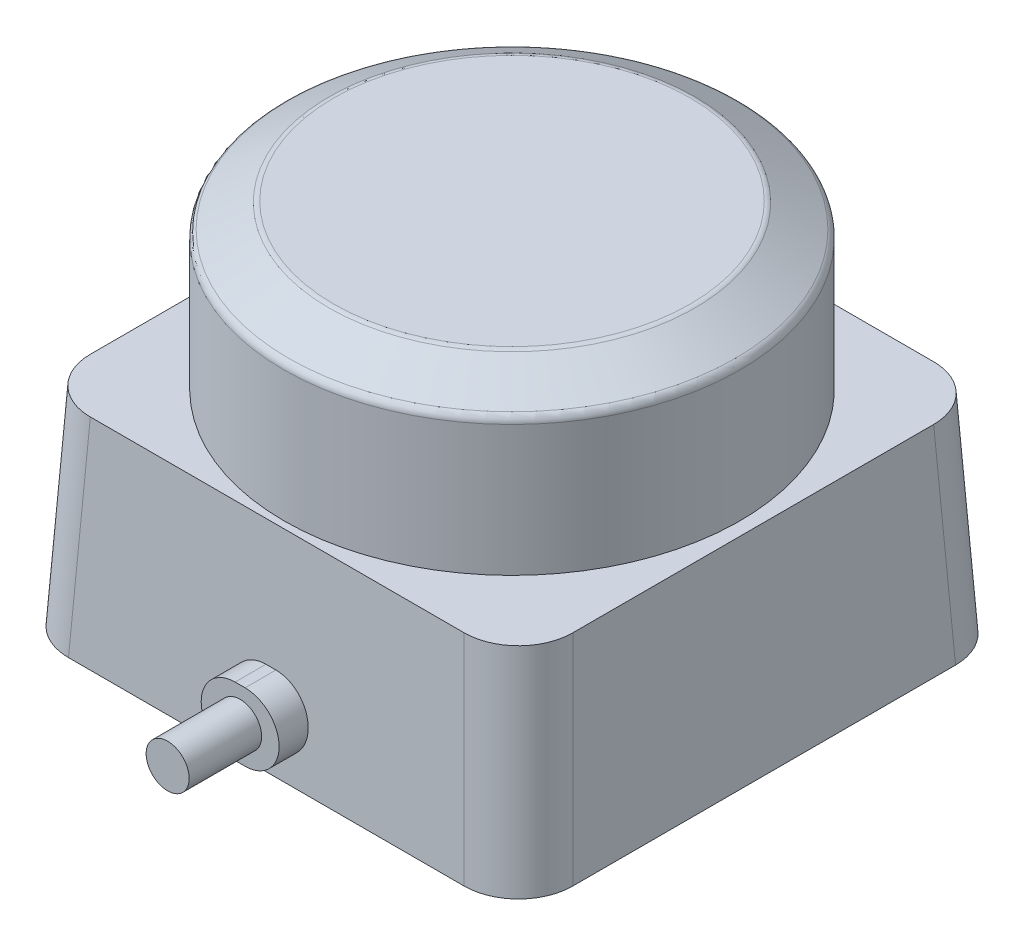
ISO-10303-21;
HEADER;
FILE_DESCRIPTION(('STEP AP214'),'2;1');
FILE_NAME('part.step','',(''),(''),'','','');
FILE_SCHEMA(('AUTOMOTIVE_DESIGN { 1 0 10303 214 1 1 1 1 }'));
ENDSEC;
DATA;
#1=APPLICATION_CONTEXT('core data for automotive mechanical design processes');
#2=APPLICATION_PROTOCOL_DEFINITION('international standard','automotive_design',2000,#1);
#3=PRODUCT_CONTEXT('',#1,'mechanical');
#4=PRODUCT('Part','Part','',(#3));
#5=PRODUCT_RELATED_PRODUCT_CATEGORY('part','',(#4));
#6=PRODUCT_DEFINITION_FORMATION('','',#4);
#7=PRODUCT_DEFINITION_CONTEXT('part definition',#1,'design');
#8=PRODUCT_DEFINITION('design','',#6,#7);
#9=PRODUCT_DEFINITION_SHAPE('','',#8);
#10=(LENGTH_UNIT() NAMED_UNIT(*) SI_UNIT(.MILLI.,.METRE.));
#11=(NAMED_UNIT(*) PLANE_ANGLE_UNIT() SI_UNIT($,.RADIAN.));
#12=(NAMED_UNIT(*) SI_UNIT($,.STERADIAN.) SOLID_ANGLE_UNIT());
#13=UNCERTAINTY_MEASURE_WITH_UNIT(LENGTH_MEASURE(1.E-05),#10,'distance_accuracy_value','');
#14=(GEOMETRIC_REPRESENTATION_CONTEXT(3) GLOBAL_UNCERTAINTY_ASSIGNED_CONTEXT((#13)) GLOBAL_UNIT_ASSIGNED_CONTEXT((#10,
#11,#12)) REPRESENTATION_CONTEXT('',''));
#15=CARTESIAN_POINT('',(0.,0.,0.));
#16=DIRECTION('',(0.,0.,1.));
#17=DIRECTION('',(1.,0.,0.));
#18=AXIS2_PLACEMENT_3D('',#15,#16,#17);
#19=CARTESIAN_POINT('',(27.825,0.,27.1102578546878));
#20=DIRECTION('',(0.,0.0523359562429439,0.998629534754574));
#21=DIRECTION('',(0.,-0.998629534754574,0.052335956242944));
#22=AXIS2_PLACEMENT_3D('',#19,#20,#21);
#23=PLANE('',#22);
#24=DIRECTION('',(-1.,0.,0.));
#25=VECTOR('',#24,1.);
#26=CARTESIAN_POINT('',(27.825,23.,25.9048789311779));
#27=LINE('',#26,#25);
#28=CARTESIAN_POINT('',(-20.6278438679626,23.,25.9048789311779));
#29=VERTEX_POINT('',#28);
#30=CARTESIAN_POINT('',(20.6278438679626,23.,25.9048789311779));
#31=VERTEX_POINT('',#30);
#32=EDGE_CURVE('E195',#29,#31,#27,.F.);
#33=ORIENTED_EDGE('',*,*,#32,.F.);
#34=DIRECTION('',(0.0522644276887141,0.997264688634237,-0.052264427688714));
#35=VECTOR('',#34,1.);
#36=CARTESIAN_POINT('',(-21.6975778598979,2.58825948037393,26.9746129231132));
#37=LINE('',#36,#35);
#38=CARTESIAN_POINT('',(-21.8332227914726,0.,27.1102578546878));
#39=VERTEX_POINT('',#38);
#40=EDGE_CURVE('E252',#29,#39,#37,.F.);
#41=ORIENTED_EDGE('',*,*,#40,.T.);
#42=DIRECTION('',(1.,0.,0.));
#43=VECTOR('',#42,1.);
#44=CARTESIAN_POINT('',(27.825,0.,27.1102578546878));
#45=LINE('',#44,#43);
#46=CARTESIAN_POINT('',(21.8332227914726,0.,27.1102578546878));
#47=VERTEX_POINT('',#46);
#48=EDGE_CURVE('E169',#39,#47,#45,.T.);
#49=ORIENTED_EDGE('',*,*,#48,.T.);
#50=DIRECTION('',(-0.0522644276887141,0.997264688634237,-0.052264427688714));
#51=VECTOR('',#50,1.);
#52=CARTESIAN_POINT('',(21.8495897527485,-0.312300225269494,27.1266248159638));
#53=LINE('',#52,#51);
#54=EDGE_CURVE('E249',#47,#31,#53,.T.);
#55=ORIENTED_EDGE('',*,*,#54,.T.);
#56=EDGE_LOOP('',(#33,#41,#49,#55));
#57=FACE_BOUND('',#56,.T.);
#58=CARTESIAN_POINT('',(0.55,6.,26.7958111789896));
#59=DIRECTION('',(0.,0.0523359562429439,0.998629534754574));
#60=DIRECTION('',(0.,0.998629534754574,-0.052335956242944));
#61=AXIS2_PLACEMENT_3D('',#58,#59,#60);
#62=ELLIPSE('',#61,3.7551462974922,3.75);
#63=CARTESIAN_POINT('',(0.549999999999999,2.25,26.992340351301));
#64=VERTEX_POINT('',#63);
#65=CARTESIAN_POINT('',(0.549999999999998,9.75,26.5992820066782));
#66=VERTEX_POINT('',#65);
#67=EDGE_CURVE('E162',#64,#66,#62,.T.);
#68=ORIENTED_EDGE('',*,*,#67,.F.);
#69=DIRECTION('',(-1.,0.,0.));
#70=VECTOR('',#69,1.);
#71=CARTESIAN_POINT('',(27.825,2.25,26.992340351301));
#72=LINE('',#71,#70);
#73=CARTESIAN_POINT('',(-0.549999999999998,2.25,26.992340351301));
#74=VERTEX_POINT('',#73);
#75=EDGE_CURVE('E178',#74,#64,#72,.F.);
#76=ORIENTED_EDGE('',*,*,#75,.F.);
#77=CARTESIAN_POINT('',(-0.55,6.,26.7958111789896));
#78=DIRECTION('',(0.,0.0523359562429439,0.998629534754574));
#79=DIRECTION('',(0.,0.998629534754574,-0.052335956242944));
#80=AXIS2_PLACEMENT_3D('',#77,#78,#79);
#81=ELLIPSE('',#80,3.7551462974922,3.75);
#82=CARTESIAN_POINT('',(-0.55,9.75,26.5992820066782));
#83=VERTEX_POINT('',#82);
#84=EDGE_CURVE('E207',#83,#74,#81,.T.);
#85=ORIENTED_EDGE('',*,*,#84,.F.);
#86=DIRECTION('',(1.,0.,0.));
#87=VECTOR('',#86,1.);
#88=CARTESIAN_POINT('',(27.825,9.75,26.5992820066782));
#89=LINE('',#88,#87);
#90=EDGE_CURVE('E211',#66,#83,#89,.F.);
#91=ORIENTED_EDGE('',*,*,#90,.F.);
#92=EDGE_LOOP('',(#68,#76,#85,#91));
#93=FACE_BOUND('',#92,.T.);
#94=ADVANCED_FACE('F44',(#57,#93),#23,.T.);
#95=CARTESIAN_POINT('',(-27.825,0.,27.1102578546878));
#96=DIRECTION('',(-0.998629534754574,0.0523359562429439,0.));
#97=DIRECTION('',(-0.052335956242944,-0.998629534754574,0.));
#98=AXIS2_PLACEMENT_3D('',#95,#96,#97);
#99=PLANE('',#98);
#100=DIRECTION('',(0.,0.,1.));
#101=VECTOR('',#100,1.);
#102=CARTESIAN_POINT('',(-27.825,0.,27.1102578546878));
#103=LINE('',#102,#101);
#104=CARTESIAN_POINT('',(-27.825,0.,-21.1184806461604));
#105=VERTEX_POINT('',#104);
#106=CARTESIAN_POINT('',(-27.825,0.,21.1184806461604));
#107=VERTEX_POINT('',#106);
#108=EDGE_CURVE('E164',#105,#107,#103,.T.);
#109=ORIENTED_EDGE('',*,*,#108,.T.);
#110=DIRECTION('',(0.052264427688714,0.997264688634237,-0.0522644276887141));
#111=VECTOR('',#110,1.);
#112=CARTESIAN_POINT('',(-27.841366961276,-0.312300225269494,21.1348476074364));
#113=LINE('',#112,#111);
#114=CARTESIAN_POINT('',(-26.61962107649,23.,19.9131017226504));
#115=VERTEX_POINT('',#114);
#116=EDGE_CURVE('E272',#107,#115,#113,.T.);
#117=ORIENTED_EDGE('',*,*,#116,.T.);
#118=DIRECTION('',(0.,0.,-1.));
#119=VECTOR('',#118,1.);
#120=CARTESIAN_POINT('',(-26.61962107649,23.,27.1102578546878));
#121=LINE('',#120,#119);
#122=CARTESIAN_POINT('',(-26.61962107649,23.,-19.9131017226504));
#123=VERTEX_POINT('',#122);
#124=EDGE_CURVE('E191',#123,#115,#121,.F.);
#125=ORIENTED_EDGE('',*,*,#124,.F.);
#126=DIRECTION('',(0.052264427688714,0.997264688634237,0.0522644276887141));
#127=VECTOR('',#126,1.);
#128=CARTESIAN_POINT('',(-27.6932598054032,2.5137526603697,-20.9867404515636));
#129=LINE('',#128,#127);
#130=EDGE_CURVE('E268',#123,#105,#129,.F.);
#131=ORIENTED_EDGE('',*,*,#130,.T.);
#132=EDGE_LOOP('',(#109,#117,#125,#131));
#133=FACE_BOUND('',#132,.T.);
#134=ADVANCED_FACE('F333',(#133),#99,.T.);
#135=CARTESIAN_POINT('',(27.825,0.,27.1102578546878));
#136=DIRECTION('',(0.998629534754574,0.0523359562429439,0.));
#137=DIRECTION('',(-0.052335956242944,0.998629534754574,0.));
#138=AXIS2_PLACEMENT_3D('',#135,#136,#137);
#139=PLANE('',#138);
#140=DIRECTION('',(0.,0.,-1.));
#141=VECTOR('',#140,1.);
#142=CARTESIAN_POINT('',(27.825,0.,27.1102578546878));
#143=LINE('',#142,#141);
#144=CARTESIAN_POINT('',(27.825,0.,21.1184806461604));
#145=VERTEX_POINT('',#144);
#146=CARTESIAN_POINT('',(27.825,0.,-21.1184806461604));
#147=VERTEX_POINT('',#146);
#148=EDGE_CURVE('E184',#145,#147,#143,.T.);
#149=ORIENTED_EDGE('',*,*,#148,.T.);
#150=DIRECTION('',(-0.052264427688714,0.997264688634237,0.0522644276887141));
#151=VECTOR('',#150,1.);
#152=CARTESIAN_POINT('',(27.6932598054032,2.5137526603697,-20.9867404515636));
#153=LINE('',#152,#151);
#154=CARTESIAN_POINT('',(26.61962107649,23.,-19.9131017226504));
#155=VERTEX_POINT('',#154);
#156=EDGE_CURVE('E296',#147,#155,#153,.T.);
#157=ORIENTED_EDGE('',*,*,#156,.T.);
#158=DIRECTION('',(0.,0.,1.));
#159=VECTOR('',#158,1.);
#160=CARTESIAN_POINT('',(26.61962107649,23.,27.1102578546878));
#161=LINE('',#160,#159);
#162=CARTESIAN_POINT('',(26.61962107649,23.,19.9131017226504));
#163=VERTEX_POINT('',#162);
#164=EDGE_CURVE('E199',#163,#155,#161,.F.);
#165=ORIENTED_EDGE('',*,*,#164,.F.);
#166=DIRECTION('',(-0.052264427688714,0.997264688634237,-0.0522644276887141));
#167=VECTOR('',#166,1.);
#168=CARTESIAN_POINT('',(27.841366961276,-0.312300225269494,21.1348476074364));
#169=LINE('',#168,#167);
#170=EDGE_CURVE('E292',#163,#145,#169,.F.);
#171=ORIENTED_EDGE('',*,*,#170,.T.);
#172=EDGE_LOOP('',(#149,#157,#165,#171));
#173=FACE_BOUND('',#172,.T.);
#174=ADVANCED_FACE('F339',(#173),#139,.T.);
#175=CARTESIAN_POINT('',(27.825,0.,-27.1102578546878));
#176=DIRECTION('',(0.,0.0523359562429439,-0.998629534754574));
#177=DIRECTION('',(0.,0.998629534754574,0.052335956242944));
#178=AXIS2_PLACEMENT_3D('',#175,#176,#177);
#179=PLANE('',#178);
#180=DIRECTION('',(-1.,0.,0.));
#181=VECTOR('',#180,1.);
#182=CARTESIAN_POINT('',(27.825,0.,-27.1102578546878));
#183=LINE('',#182,#181);
#184=CARTESIAN_POINT('',(21.8332227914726,0.,-27.1102578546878));
#185=VERTEX_POINT('',#184);
#186=CARTESIAN_POINT('',(-21.8332227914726,0.,-27.1102578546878));
#187=VERTEX_POINT('',#186);
#188=EDGE_CURVE('E188',#185,#187,#183,.T.);
#189=ORIENTED_EDGE('',*,*,#188,.T.);
#190=DIRECTION('',(0.0522644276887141,0.997264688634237,0.052264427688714));
#191=VECTOR('',#190,1.);
#192=CARTESIAN_POINT('',(-21.6975778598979,2.58825948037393,-26.9746129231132));
#193=LINE('',#192,#191);
#194=CARTESIAN_POINT('',(-20.6278438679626,23.,-25.9048789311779));
#195=VERTEX_POINT('',#194);
#196=EDGE_CURVE('E60',#187,#195,#193,.T.);
#197=ORIENTED_EDGE('',*,*,#196,.T.);
#198=DIRECTION('',(1.,0.,0.));
#199=VECTOR('',#198,1.);
#200=CARTESIAN_POINT('',(27.825,23.,-25.9048789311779));
#201=LINE('',#200,#199);
#202=CARTESIAN_POINT('',(20.6278438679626,23.,-25.9048789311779));
#203=VERTEX_POINT('',#202);
#204=EDGE_CURVE('E179',#203,#195,#201,.F.);
#205=ORIENTED_EDGE('',*,*,#204,.F.);
#206=DIRECTION('',(-0.0522644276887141,0.997264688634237,0.052264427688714));
#207=VECTOR('',#206,1.);
#208=CARTESIAN_POINT('',(21.8495897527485,-0.312300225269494,-27.1266248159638));
#209=LINE('',#208,#207);
#210=EDGE_CURVE('E286',#203,#185,#209,.F.);
#211=ORIENTED_EDGE('',*,*,#210,.T.);
#212=EDGE_LOOP('',(#189,#197,#205,#211));
#213=FACE_BOUND('',#212,.T.);
#214=ADVANCED_FACE('F405',(#213),#179,.T.);
#215=CARTESIAN_POINT('',(0.,23.,0.));
#216=DIRECTION('',(0.,1.,0.));
#217=DIRECTION('',(0.,0.,1.));
#218=AXIS2_PLACEMENT_3D('',#215,#216,#217);
#219=PLANE('',#218);
#220=CARTESIAN_POINT('',(0.,23.,0.));
#221=DIRECTION('',(0.,1.,0.));
#222=DIRECTION('',(0.,0.,1.));
#223=AXIS2_PLACEMENT_3D('',#220,#221,#222);
#224=CIRCLE('',#223,25.15);
#225=CARTESIAN_POINT('',(0.,23.,25.15));
#226=VERTEX_POINT('',#225);
#227=EDGE_CURVE('E175',#226,#226,#224,.T.);
#228=ORIENTED_EDGE('',*,*,#227,.F.);
#229=EDGE_LOOP('',(#228));
#230=FACE_BOUND('',#229,.T.);
#231=ORIENTED_EDGE('',*,*,#124,.T.);
#232=CARTESIAN_POINT('',(-20.6113870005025,23.,19.8966448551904));
#233=DIRECTION('',(0.,1.,0.));
#234=DIRECTION('',(-0.707106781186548,0.,0.707106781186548));
#235=AXIS2_PLACEMENT_3D('',#232,#233,#234);
#236=ELLIPSE('',#235,6.0164568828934,6.);
#237=EDGE_CURVE('E283',#115,#29,#236,.T.);
#238=ORIENTED_EDGE('',*,*,#237,.T.);
#239=ORIENTED_EDGE('',*,*,#32,.T.);
#240=CARTESIAN_POINT('',(20.6113870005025,23.,19.8966448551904));
#241=DIRECTION('',(0.,1.,0.));
#242=DIRECTION('',(0.707106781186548,0.,0.707106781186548));
#243=AXIS2_PLACEMENT_3D('',#240,#241,#242);
#244=ELLIPSE('',#243,6.0164568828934,6.);
#245=EDGE_CURVE('E275',#31,#163,#244,.T.);
#246=ORIENTED_EDGE('',*,*,#245,.T.);
#247=ORIENTED_EDGE('',*,*,#164,.T.);
#248=CARTESIAN_POINT('',(20.6113870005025,23.,-19.8966448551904));
#249=DIRECTION('',(0.,1.,0.));
#250=DIRECTION('',(0.707106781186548,0.,-0.707106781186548));
#251=AXIS2_PLACEMENT_3D('',#248,#249,#250);
#252=ELLIPSE('',#251,6.0164568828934,6.);
#253=EDGE_CURVE('E67',#155,#203,#252,.T.);
#254=ORIENTED_EDGE('',*,*,#253,.T.);
#255=ORIENTED_EDGE('',*,*,#204,.T.);
#256=CARTESIAN_POINT('',(-20.6113870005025,23.,-19.8966448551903));
#257=DIRECTION('',(0.,1.,0.));
#258=DIRECTION('',(-0.707106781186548,0.,-0.707106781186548));
#259=AXIS2_PLACEMENT_3D('',#256,#257,#258);
#260=ELLIPSE('',#259,6.0164568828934,6.);
#261=EDGE_CURVE('E280',#195,#123,#260,.T.);
#262=ORIENTED_EDGE('',*,*,#261,.T.);
#263=EDGE_LOOP('',(#231,#238,#239,#246,#247,#254,#255,#262));
#264=FACE_BOUND('',#263,.T.);
#265=ADVANCED_FACE('F399',(#230,#264),#219,.T.);
#266=CARTESIAN_POINT('',(0.,0.,0.));
#267=DIRECTION('',(0.,1.,0.));
#268=DIRECTION('',(0.,0.,1.));
#269=AXIS2_PLACEMENT_3D('',#266,#267,#268);
#270=PLANE('',#269);
#271=CARTESIAN_POINT('',(21.4,0.,-21.4));
#272=DIRECTION('',(0.,1.,0.));
#273=DIRECTION('',(0.,0.,1.));
#274=AXIS2_PLACEMENT_3D('',#271,#272,#273);
#275=CIRCLE('',#274,1.45);
#276=CARTESIAN_POINT('',(21.4,0.,-19.95));
#277=VERTEX_POINT('',#276);
#278=EDGE_CURVE('E233',#277,#277,#275,.T.);
#279=ORIENTED_EDGE('',*,*,#278,.T.);
#280=EDGE_LOOP('',(#279));
#281=FACE_BOUND('',#280,.T.);
#282=CARTESIAN_POINT('',(-21.4,0.,-21.4));
#283=DIRECTION('',(0.,1.,0.));
#284=DIRECTION('',(0.,0.,1.));
#285=AXIS2_PLACEMENT_3D('',#282,#283,#284);
#286=CIRCLE('',#285,1.45);
#287=CARTESIAN_POINT('',(-21.4,0.,-19.95));
#288=VERTEX_POINT('',#287);
#289=EDGE_CURVE('E229',#288,#288,#286,.T.);
#290=ORIENTED_EDGE('',*,*,#289,.T.);
#291=EDGE_LOOP('',(#290));
#292=FACE_BOUND('',#291,.T.);
#293=CARTESIAN_POINT('',(21.4,0.,21.4));
#294=DIRECTION('',(0.,1.,0.));
#295=DIRECTION('',(0.,0.,1.));
#296=AXIS2_PLACEMENT_3D('',#293,#294,#295);
#297=CIRCLE('',#296,1.45);
#298=CARTESIAN_POINT('',(21.4,0.,22.85));
#299=VERTEX_POINT('',#298);
#300=EDGE_CURVE('E225',#299,#299,#297,.T.);
#301=ORIENTED_EDGE('',*,*,#300,.T.);
#302=EDGE_LOOP('',(#301));
#303=FACE_BOUND('',#302,.T.);
#304=CARTESIAN_POINT('',(-21.4,0.,21.4));
#305=DIRECTION('',(0.,1.,0.));
#306=DIRECTION('',(0.,0.,1.));
#307=AXIS2_PLACEMENT_3D('',#304,#305,#306);
#308=CIRCLE('',#307,1.45);
#309=CARTESIAN_POINT('',(-21.4,0.,22.85));
#310=VERTEX_POINT('',#309);
#311=EDGE_CURVE('E221',#310,#310,#308,.T.);
#312=ORIENTED_EDGE('',*,*,#311,.T.);
#313=EDGE_LOOP('',(#312));
#314=FACE_BOUND('',#313,.T.);
#315=ORIENTED_EDGE('',*,*,#48,.F.);
#316=CARTESIAN_POINT('',(-21.8167659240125,0.,21.1020237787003));
#317=DIRECTION('',(0.,1.,0.));
#318=DIRECTION('',(-0.707106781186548,0.,0.707106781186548));
#319=AXIS2_PLACEMENT_3D('',#316,#317,#318);
#320=ELLIPSE('',#319,6.0164568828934,6.);
#321=EDGE_CURVE('E265',#39,#107,#320,.F.);
#322=ORIENTED_EDGE('',*,*,#321,.T.);
#323=ORIENTED_EDGE('',*,*,#108,.F.);
#324=CARTESIAN_POINT('',(-21.8167659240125,0.,-21.1020237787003));
#325=DIRECTION('',(0.,1.,0.));
#326=DIRECTION('',(-0.707106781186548,0.,-0.707106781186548));
#327=AXIS2_PLACEMENT_3D('',#324,#325,#326);
#328=ELLIPSE('',#327,6.0164568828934,6.);
#329=EDGE_CURVE('E262',#105,#187,#328,.F.);
#330=ORIENTED_EDGE('',*,*,#329,.T.);
#331=ORIENTED_EDGE('',*,*,#188,.F.);
#332=CARTESIAN_POINT('',(21.8167659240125,0.,-21.1020237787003));
#333=DIRECTION('',(0.,1.,0.));
#334=DIRECTION('',(0.707106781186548,0.,-0.707106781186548));
#335=AXIS2_PLACEMENT_3D('',#332,#333,#334);
#336=ELLIPSE('',#335,6.0164568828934,6.);
#337=EDGE_CURVE('E259',#185,#147,#336,.F.);
#338=ORIENTED_EDGE('',*,*,#337,.T.);
#339=ORIENTED_EDGE('',*,*,#148,.F.);
#340=CARTESIAN_POINT('',(21.8167659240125,0.,21.1020237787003));
#341=DIRECTION('',(0.,1.,0.));
#342=DIRECTION('',(0.707106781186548,0.,0.707106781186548));
#343=AXIS2_PLACEMENT_3D('',#340,#341,#342);
#344=ELLIPSE('',#343,6.0164568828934,6.);
#345=EDGE_CURVE('E256',#145,#47,#344,.F.);
#346=ORIENTED_EDGE('',*,*,#345,.T.);
#347=EDGE_LOOP('',(#315,#322,#323,#330,#331,#338,#339,#346));
#348=FACE_BOUND('',#347,.T.);
#349=ADVANCED_FACE('F328',(#281,#292,#303,#314,#348),#270,.F.);
#350=CARTESIAN_POINT('',(0.,41.,0.));
#351=DIRECTION('',(0.,-1.,0.));
#352=DIRECTION('',(0.,0.,-1.));
#353=AXIS2_PLACEMENT_3D('',#350,#351,#352);
#354=CYLINDRICAL_SURFACE('',#353,25.15);
#355=CARTESIAN_POINT('',(0.,37.4226497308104,0.));
#356=DIRECTION('',(0.,1.,0.));
#357=DIRECTION('',(0.,0.,1.));
#358=AXIS2_PLACEMENT_3D('',#355,#356,#357);
#359=CIRCLE('',#358,25.15);
#360=CARTESIAN_POINT('',(0.,37.4226497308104,25.15));
#361=VERTEX_POINT('',#360);
#362=EDGE_CURVE('E11',#361,#361,#359,.F.);
#363=ORIENTED_EDGE('',*,*,#362,.T.);
#364=EDGE_LOOP('',(#363));
#365=FACE_BOUND('',#364,.T.);
#366=ORIENTED_EDGE('',*,*,#227,.T.);
#367=EDGE_LOOP('',(#366));
#368=FACE_BOUND('',#367,.T.);
#369=ADVANCED_FACE('F321',(#365,#368),#354,.T.);
#370=CARTESIAN_POINT('',(0.,41.,0.));
#371=DIRECTION('',(0.,1.,0.));
#372=DIRECTION('',(0.,0.,1.));
#373=AXIS2_PLACEMENT_3D('',#370,#371,#372);
#374=PLANE('',#373);
#375=CARTESIAN_POINT('',(0.,41.,0.));
#376=DIRECTION('',(0.,1.,0.));
#377=DIRECTION('',(0.,0.,1.));
#378=AXIS2_PLACEMENT_3D('',#375,#376,#377);
#379=CIRCLE('',#378,19.6858983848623);
#380=CARTESIAN_POINT('',(0.,41.,19.6858983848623));
#381=VERTEX_POINT('',#380);
#382=EDGE_CURVE('E299',#381,#381,#379,.T.);
#383=ORIENTED_EDGE('',*,*,#382,.T.);
#384=EDGE_LOOP('',(#383));
#385=FACE_BOUND('',#384,.T.);
#386=ADVANCED_FACE('F319',(#385),#374,.T.);
#387=CARTESIAN_POINT('',(0.,41.,0.));
#388=DIRECTION('',(0.,-1.,0.));
#389=DIRECTION('',(0.,0.,-1.));
#390=AXIS2_PLACEMENT_3D('',#387,#388,#389);
#391=CONICAL_SURFACE('',#390,19.9538475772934,1.0471975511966);
#392=CARTESIAN_POINT('',(0.,40.8660254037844,0.));
#393=DIRECTION('',(0.,1.,0.));
#394=DIRECTION('',(0.,0.,1.));
#395=AXIS2_PLACEMENT_3D('',#392,#393,#394);
#396=CIRCLE('',#395,20.1858983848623);
#397=CARTESIAN_POINT('',(0.,40.8660254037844,20.1858983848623));
#398=VERTEX_POINT('',#397);
#399=EDGE_CURVE('E53',#398,#398,#396,.F.);
#400=ORIENTED_EDGE('',*,*,#399,.T.);
#401=EDGE_LOOP('',(#400));
#402=FACE_BOUND('',#401,.T.);
#403=CARTESIAN_POINT('',(0.,38.2886751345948,0.));
#404=DIRECTION('',(0.,-1.,0.));
#405=DIRECTION('',(0.,0.,-1.));
#406=AXIS2_PLACEMENT_3D('',#403,#404,#405);
#407=CIRCLE('',#406,24.65);
#408=CARTESIAN_POINT('',(0.,38.2886751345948,-24.65));
#409=VERTEX_POINT('',#408);
#410=EDGE_CURVE('E303',#409,#409,#407,.F.);
#411=ORIENTED_EDGE('',*,*,#410,.T.);
#412=EDGE_LOOP('',(#411));
#413=FACE_BOUND('',#412,.T.);
#414=ADVANCED_FACE('F310',(#402,#413),#391,.T.);
#415=CARTESIAN_POINT('',(0.55,6.,30.));
#416=DIRECTION('',(0.,0.,-1.));
#417=DIRECTION('',(-1.,0.,0.));
#418=AXIS2_PLACEMENT_3D('',#415,#416,#417);
#419=CYLINDRICAL_SURFACE('',#418,3.75);
#420=DIRECTION('',(0.,0.,-1.));
#421=VECTOR('',#420,1.);
#422=CARTESIAN_POINT('',(0.549999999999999,2.25,30.));
#423=LINE('',#422,#421);
#424=CARTESIAN_POINT('',(0.549999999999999,2.25,30.));
#425=VERTEX_POINT('',#424);
#426=EDGE_CURVE('E755',#425,#64,#423,.T.);
#427=ORIENTED_EDGE('',*,*,#426,.T.);
#428=ORIENTED_EDGE('',*,*,#67,.T.);
#429=DIRECTION('',(0.,0.,-1.));
#430=VECTOR('',#429,1.);
#431=CARTESIAN_POINT('',(0.55,9.75,30.));
#432=LINE('',#431,#430);
#433=CARTESIAN_POINT('',(0.55,9.75,30.));
#434=VERTEX_POINT('',#433);
#435=EDGE_CURVE('E141',#434,#66,#432,.T.);
#436=ORIENTED_EDGE('',*,*,#435,.F.);
#437=CARTESIAN_POINT('',(0.55,6.,30.));
#438=DIRECTION('',(0.,0.,1.));
#439=DIRECTION('',(1.,0.,0.));
#440=AXIS2_PLACEMENT_3D('',#437,#438,#439);
#441=CIRCLE('',#440,3.75);
#442=EDGE_CURVE('E148',#425,#434,#441,.T.);
#443=ORIENTED_EDGE('',*,*,#442,.F.);
#444=EDGE_LOOP('',(#427,#428,#436,#443));
#445=FACE_BOUND('',#444,.T.);
#446=ADVANCED_FACE('F161',(#445),#419,.T.);
#447=CARTESIAN_POINT('',(0.55,9.75,30.));
#448=DIRECTION('',(0.,-1.,0.));
#449=DIRECTION('',(0.,0.,-1.));
#450=AXIS2_PLACEMENT_3D('',#447,#448,#449);
#451=PLANE('',#450);
#452=ORIENTED_EDGE('',*,*,#435,.T.);
#453=ORIENTED_EDGE('',*,*,#90,.T.);
#454=DIRECTION('',(0.,0.,-1.));
#455=VECTOR('',#454,1.);
#456=CARTESIAN_POINT('',(-0.55,9.75,30.));
#457=LINE('',#456,#455);
#458=CARTESIAN_POINT('',(-0.55,9.75,30.));
#459=VERTEX_POINT('',#458);
#460=EDGE_CURVE('E143',#459,#83,#457,.T.);
#461=ORIENTED_EDGE('',*,*,#460,.F.);
#462=DIRECTION('',(-1.,0.,0.));
#463=VECTOR('',#462,1.);
#464=CARTESIAN_POINT('',(0.55,9.75,30.));
#465=LINE('',#464,#463);
#466=EDGE_CURVE('E136',#434,#459,#465,.T.);
#467=ORIENTED_EDGE('',*,*,#466,.F.);
#468=EDGE_LOOP('',(#452,#453,#461,#467));
#469=FACE_BOUND('',#468,.T.);
#470=ADVANCED_FACE('F138',(#469),#451,.F.);
#471=CARTESIAN_POINT('',(-0.55,6.,30.));
#472=DIRECTION('',(0.,0.,-1.));
#473=DIRECTION('',(-1.,0.,0.));
#474=AXIS2_PLACEMENT_3D('',#471,#472,#473);
#475=CYLINDRICAL_SURFACE('',#474,3.75);
#476=ORIENTED_EDGE('',*,*,#460,.T.);
#477=ORIENTED_EDGE('',*,*,#84,.T.);
#478=DIRECTION('',(0.,0.,-1.));
#479=VECTOR('',#478,1.);
#480=CARTESIAN_POINT('',(-0.549999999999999,2.25,30.));
#481=LINE('',#480,#479);
#482=CARTESIAN_POINT('',(-0.549999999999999,2.25,30.));
#483=VERTEX_POINT('',#482);
#484=EDGE_CURVE('E171',#483,#74,#481,.T.);
#485=ORIENTED_EDGE('',*,*,#484,.F.);
#486=CARTESIAN_POINT('',(-0.55,6.,30.));
#487=DIRECTION('',(0.,0.,1.));
#488=DIRECTION('',(1.,0.,0.));
#489=AXIS2_PLACEMENT_3D('',#486,#487,#488);
#490=CIRCLE('',#489,3.75);
#491=EDGE_CURVE('E147',#459,#483,#490,.T.);
#492=ORIENTED_EDGE('',*,*,#491,.F.);
#493=EDGE_LOOP('',(#476,#477,#485,#492));
#494=FACE_BOUND('',#493,.T.);
#495=ADVANCED_FACE('F599',(#494),#475,.T.);
#496=CARTESIAN_POINT('',(0.549999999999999,2.25,30.));
#497=DIRECTION('',(0.,1.,0.));
#498=DIRECTION('',(0.,0.,1.));
#499=AXIS2_PLACEMENT_3D('',#496,#497,#498);
#500=PLANE('',#499);
#501=ORIENTED_EDGE('',*,*,#484,.T.);
#502=ORIENTED_EDGE('',*,*,#75,.T.);
#503=ORIENTED_EDGE('',*,*,#426,.F.);
#504=DIRECTION('',(1.,0.,0.));
#505=VECTOR('',#504,1.);
#506=CARTESIAN_POINT('',(0.549999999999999,2.25,30.));
#507=LINE('',#506,#505);
#508=EDGE_CURVE('E153',#483,#425,#507,.T.);
#509=ORIENTED_EDGE('',*,*,#508,.F.);
#510=EDGE_LOOP('',(#501,#502,#503,#509));
#511=FACE_BOUND('',#510,.T.);
#512=ADVANCED_FACE('F588',(#511),#500,.F.);
#513=CARTESIAN_POINT('',(0.55,6.,30.));
#514=DIRECTION('',(0.,0.,1.));
#515=DIRECTION('',(1.,0.,0.));
#516=AXIS2_PLACEMENT_3D('',#513,#514,#515);
#517=PLANE('',#516);
#518=CARTESIAN_POINT('',(0.,6.,30.));
#519=DIRECTION('',(0.,0.,1.));
#520=DIRECTION('',(1.,0.,0.));
#521=AXIS2_PLACEMENT_3D('',#518,#519,#520);
#522=CIRCLE('',#521,2.375);
#523=CARTESIAN_POINT('',(2.375,6.,30.));
#524=VERTEX_POINT('',#523);
#525=EDGE_CURVE('E216',#524,#524,#522,.T.);
#526=ORIENTED_EDGE('',*,*,#525,.F.);
#527=EDGE_LOOP('',(#526));
#528=FACE_BOUND('',#527,.T.);
#529=ORIENTED_EDGE('',*,*,#442,.T.);
#530=ORIENTED_EDGE('',*,*,#466,.T.);
#531=ORIENTED_EDGE('',*,*,#491,.T.);
#532=ORIENTED_EDGE('',*,*,#508,.T.);
#533=EDGE_LOOP('',(#529,#530,#531,#532));
#534=FACE_BOUND('',#533,.T.);
#535=ADVANCED_FACE('F151',(#528,#534),#517,.T.);
#536=CARTESIAN_POINT('',(0.,6.,38.));
#537=DIRECTION('',(0.,0.,-1.));
#538=DIRECTION('',(-1.,0.,0.));
#539=AXIS2_PLACEMENT_3D('',#536,#537,#538);
#540=CYLINDRICAL_SURFACE('',#539,2.375);
#541=CARTESIAN_POINT('',(0.,6.,38.));
#542=DIRECTION('',(0.,0.,1.));
#543=DIRECTION('',(1.,0.,0.));
#544=AXIS2_PLACEMENT_3D('',#541,#542,#543);
#545=CIRCLE('',#544,2.375);
#546=CARTESIAN_POINT('',(2.375,6.,38.));
#547=VERTEX_POINT('',#546);
#548=EDGE_CURVE('E158',#547,#547,#545,.T.);
#549=ORIENTED_EDGE('',*,*,#548,.F.);
#550=EDGE_LOOP('',(#549));
#551=FACE_BOUND('',#550,.T.);
#552=ORIENTED_EDGE('',*,*,#525,.T.);
#553=EDGE_LOOP('',(#552));
#554=FACE_BOUND('',#553,.T.);
#555=ADVANCED_FACE('F567',(#551,#554),#540,.T.);
#556=CARTESIAN_POINT('',(0.,6.,38.));
#557=DIRECTION('',(0.,0.,1.));
#558=DIRECTION('',(1.,0.,0.));
#559=AXIS2_PLACEMENT_3D('',#556,#557,#558);
#560=PLANE('',#559);
#561=ORIENTED_EDGE('',*,*,#548,.T.);
#562=EDGE_LOOP('',(#561));
#563=FACE_BOUND('',#562,.T.);
#564=ADVANCED_FACE('F524',(#563),#560,.T.);
#565=CARTESIAN_POINT('',(-21.4,5.,21.4));
#566=DIRECTION('',(0.,-1.,0.));
#567=DIRECTION('',(0.,0.,-1.));
#568=AXIS2_PLACEMENT_3D('',#565,#566,#567);
#569=CYLINDRICAL_SURFACE('',#568,1.25);
#570=CARTESIAN_POINT('',(-21.4,0.346410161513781,21.4));
#571=DIRECTION('',(0.,1.,0.));
#572=DIRECTION('',(0.,0.,1.));
#573=AXIS2_PLACEMENT_3D('',#570,#571,#572);
#574=CIRCLE('',#573,1.25);
#575=CARTESIAN_POINT('',(-21.4,0.346410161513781,22.65));
#576=VERTEX_POINT('',#575);
#577=EDGE_CURVE('E245',#576,#576,#574,.F.);
#578=ORIENTED_EDGE('',*,*,#577,.T.);
#579=EDGE_LOOP('',(#578));
#580=FACE_BOUND('',#579,.T.);
#581=CARTESIAN_POINT('',(-21.4,5.,21.4));
#582=DIRECTION('',(0.,-1.,0.));
#583=DIRECTION('',(0.,0.,-1.));
#584=AXIS2_PLACEMENT_3D('',#581,#582,#583);
#585=CIRCLE('',#584,1.25);
#586=CARTESIAN_POINT('',(-21.4,5.,20.15));
#587=VERTEX_POINT('',#586);
#588=EDGE_CURVE('E767',#587,#587,#585,.T.);
#589=ORIENTED_EDGE('',*,*,#588,.F.);
#590=EDGE_LOOP('',(#589));
#591=FACE_BOUND('',#590,.T.);
#592=ADVANCED_FACE('F519',(#580,#591),#569,.F.);
#593=CARTESIAN_POINT('',(-21.4,5.,21.4));
#594=DIRECTION('',(0.,-1.,0.));
#595=DIRECTION('',(0.,0.,-1.));
#596=AXIS2_PLACEMENT_3D('',#593,#594,#595);
#597=PLANE('',#596);
#598=ORIENTED_EDGE('',*,*,#588,.T.);
#599=EDGE_LOOP('',(#598));
#600=FACE_BOUND('',#599,.T.);
#601=ADVANCED_FACE('F510',(#600),#597,.T.);
#602=CARTESIAN_POINT('',(21.4,5.,21.4));
#603=DIRECTION('',(0.,-1.,0.));
#604=DIRECTION('',(0.,0.,-1.));
#605=AXIS2_PLACEMENT_3D('',#602,#603,#604);
#606=CYLINDRICAL_SURFACE('',#605,1.25);
#607=CARTESIAN_POINT('',(21.4,0.346410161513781,21.4));
#608=DIRECTION('',(0.,1.,0.));
#609=DIRECTION('',(0.,0.,1.));
#610=AXIS2_PLACEMENT_3D('',#607,#608,#609);
#611=CIRCLE('',#610,1.25);
#612=CARTESIAN_POINT('',(21.4,0.346410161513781,22.65));
#613=VERTEX_POINT('',#612);
#614=EDGE_CURVE('E241',#613,#613,#611,.F.);
#615=ORIENTED_EDGE('',*,*,#614,.T.);
#616=EDGE_LOOP('',(#615));
#617=FACE_BOUND('',#616,.T.);
#618=CARTESIAN_POINT('',(21.4,5.,21.4));
#619=DIRECTION('',(0.,-1.,0.));
#620=DIRECTION('',(0.,0.,-1.));
#621=AXIS2_PLACEMENT_3D('',#618,#619,#620);
#622=CIRCLE('',#621,1.25);
#623=CARTESIAN_POINT('',(21.4,5.,20.15));
#624=VERTEX_POINT('',#623);
#625=EDGE_CURVE('E771',#624,#624,#622,.T.);
#626=ORIENTED_EDGE('',*,*,#625,.F.);
#627=EDGE_LOOP('',(#626));
#628=FACE_BOUND('',#627,.T.);
#629=ADVANCED_FACE('F505',(#617,#628),#606,.F.);
#630=CARTESIAN_POINT('',(21.4,5.,21.4));
#631=DIRECTION('',(0.,-1.,0.));
#632=DIRECTION('',(0.,0.,-1.));
#633=AXIS2_PLACEMENT_3D('',#630,#631,#632);
#634=PLANE('',#633);
#635=ORIENTED_EDGE('',*,*,#625,.T.);
#636=EDGE_LOOP('',(#635));
#637=FACE_BOUND('',#636,.T.);
#638=ADVANCED_FACE('F496',(#637),#634,.T.);
#639=CARTESIAN_POINT('',(21.4,5.,-21.4));
#640=DIRECTION('',(0.,-1.,0.));
#641=DIRECTION('',(0.,0.,-1.));
#642=AXIS2_PLACEMENT_3D('',#639,#640,#641);
#643=CYLINDRICAL_SURFACE('',#642,1.25);
#644=CARTESIAN_POINT('',(21.4,0.346410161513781,-21.4));
#645=DIRECTION('',(0.,1.,0.));
#646=DIRECTION('',(0.,0.,1.));
#647=AXIS2_PLACEMENT_3D('',#644,#645,#646);
#648=CIRCLE('',#647,1.25);
#649=CARTESIAN_POINT('',(21.4,0.346410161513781,-20.15));
#650=VERTEX_POINT('',#649);
#651=EDGE_CURVE('E217',#650,#650,#648,.F.);
#652=ORIENTED_EDGE('',*,*,#651,.T.);
#653=EDGE_LOOP('',(#652));
#654=FACE_BOUND('',#653,.T.);
#655=CARTESIAN_POINT('',(21.4,5.,-21.4));
#656=DIRECTION('',(0.,-1.,0.));
#657=DIRECTION('',(0.,0.,-1.));
#658=AXIS2_PLACEMENT_3D('',#655,#656,#657);
#659=CIRCLE('',#658,1.25);
#660=CARTESIAN_POINT('',(21.4,5.,-22.65));
#661=VERTEX_POINT('',#660);
#662=EDGE_CURVE('E776',#661,#661,#659,.T.);
#663=ORIENTED_EDGE('',*,*,#662,.F.);
#664=EDGE_LOOP('',(#663));
#665=FACE_BOUND('',#664,.T.);
#666=ADVANCED_FACE('F491',(#654,#665),#643,.F.);
#667=CARTESIAN_POINT('',(21.4,5.,-21.4));
#668=DIRECTION('',(0.,-1.,0.));
#669=DIRECTION('',(0.,0.,-1.));
#670=AXIS2_PLACEMENT_3D('',#667,#668,#669);
#671=PLANE('',#670);
#672=ORIENTED_EDGE('',*,*,#662,.T.);
#673=EDGE_LOOP('',(#672));
#674=FACE_BOUND('',#673,.T.);
#675=ADVANCED_FACE('F482',(#674),#671,.T.);
#676=CARTESIAN_POINT('',(-21.4,5.,-21.4));
#677=DIRECTION('',(0.,-1.,0.));
#678=DIRECTION('',(0.,0.,-1.));
#679=AXIS2_PLACEMENT_3D('',#676,#677,#678);
#680=CYLINDRICAL_SURFACE('',#679,1.25);
#681=CARTESIAN_POINT('',(-21.4,0.346410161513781,-21.4));
#682=DIRECTION('',(0.,1.,0.));
#683=DIRECTION('',(0.,0.,1.));
#684=AXIS2_PLACEMENT_3D('',#681,#682,#683);
#685=CIRCLE('',#684,1.25);
#686=CARTESIAN_POINT('',(-21.4,0.346410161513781,-20.15));
#687=VERTEX_POINT('',#686);
#688=EDGE_CURVE('E237',#687,#687,#685,.F.);
#689=ORIENTED_EDGE('',*,*,#688,.T.);
#690=EDGE_LOOP('',(#689));
#691=FACE_BOUND('',#690,.T.);
#692=CARTESIAN_POINT('',(-21.4,5.,-21.4));
#693=DIRECTION('',(0.,-1.,0.));
#694=DIRECTION('',(0.,0.,-1.));
#695=AXIS2_PLACEMENT_3D('',#692,#693,#694);
#696=CIRCLE('',#695,1.25);
#697=CARTESIAN_POINT('',(-21.4,5.,-22.65));
#698=VERTEX_POINT('',#697);
#699=EDGE_CURVE('E772',#698,#698,#696,.T.);
#700=ORIENTED_EDGE('',*,*,#699,.F.);
#701=EDGE_LOOP('',(#700));
#702=FACE_BOUND('',#701,.T.);
#703=ADVANCED_FACE('F477',(#691,#702),#680,.F.);
#704=CARTESIAN_POINT('',(-21.4,5.,-21.4));
#705=DIRECTION('',(0.,-1.,0.));
#706=DIRECTION('',(0.,0.,-1.));
#707=AXIS2_PLACEMENT_3D('',#704,#705,#706);
#708=PLANE('',#707);
#709=ORIENTED_EDGE('',*,*,#699,.T.);
#710=EDGE_LOOP('',(#709));
#711=FACE_BOUND('',#710,.T.);
#712=ADVANCED_FACE('F358',(#711),#708,.T.);
#713=CARTESIAN_POINT('',(21.4,0.346410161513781,-21.4));
#714=DIRECTION('',(0.,-1.,0.));
#715=DIRECTION('',(0.,0.,-1.));
#716=AXIS2_PLACEMENT_3D('',#713,#714,#715);
#717=CONICAL_SURFACE('',#716,1.25,0.523598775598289);
#718=ORIENTED_EDGE('',*,*,#278,.F.);
#719=EDGE_LOOP('',(#718));
#720=FACE_BOUND('',#719,.T.);
#721=ORIENTED_EDGE('',*,*,#651,.F.);
#722=EDGE_LOOP('',(#721));
#723=FACE_BOUND('',#722,.T.);
#724=ADVANCED_FACE('F351',(#720,#723),#717,.F.);
#725=CARTESIAN_POINT('',(-21.4,0.346410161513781,-21.4));
#726=DIRECTION('',(0.,-1.,0.));
#727=DIRECTION('',(0.,0.,-1.));
#728=AXIS2_PLACEMENT_3D('',#725,#726,#727);
#729=CONICAL_SURFACE('',#728,1.25,0.523598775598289);
#730=ORIENTED_EDGE('',*,*,#289,.F.);
#731=EDGE_LOOP('',(#730));
#732=FACE_BOUND('',#731,.T.);
#733=ORIENTED_EDGE('',*,*,#688,.F.);
#734=EDGE_LOOP('',(#733));
#735=FACE_BOUND('',#734,.T.);
#736=ADVANCED_FACE('F357',(#732,#735),#729,.F.);
#737=CARTESIAN_POINT('',(21.4,0.346410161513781,21.4));
#738=DIRECTION('',(0.,-1.,0.));
#739=DIRECTION('',(0.,0.,-1.));
#740=AXIS2_PLACEMENT_3D('',#737,#738,#739);
#741=CONICAL_SURFACE('',#740,1.25,0.523598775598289);
#742=ORIENTED_EDGE('',*,*,#300,.F.);
#743=EDGE_LOOP('',(#742));
#744=FACE_BOUND('',#743,.T.);
#745=ORIENTED_EDGE('',*,*,#614,.F.);
#746=EDGE_LOOP('',(#745));
#747=FACE_BOUND('',#746,.T.);
#748=ADVANCED_FACE('F365',(#744,#747),#741,.F.);
#749=CARTESIAN_POINT('',(-21.4,0.346410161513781,21.4));
#750=DIRECTION('',(0.,-1.,0.));
#751=DIRECTION('',(0.,0.,-1.));
#752=AXIS2_PLACEMENT_3D('',#749,#750,#751);
#753=CONICAL_SURFACE('',#752,1.25,0.523598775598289);
#754=ORIENTED_EDGE('',*,*,#311,.F.);
#755=EDGE_LOOP('',(#754));
#756=FACE_BOUND('',#755,.T.);
#757=ORIENTED_EDGE('',*,*,#577,.F.);
#758=EDGE_LOOP('',(#757));
#759=FACE_BOUND('',#758,.T.);
#760=ADVANCED_FACE('F372',(#756,#759),#753,.F.);
#761=CARTESIAN_POINT('',(-21.6975778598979,2.27424374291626,20.9828357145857));
#762=DIRECTION('',(-0.052264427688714,-0.997264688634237,0.052264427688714));
#763=DIRECTION('',(0.,-0.0523359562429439,-0.998629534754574));
#764=AXIS2_PLACEMENT_3D('',#761,#762,#763);
#765=CYLINDRICAL_SURFACE('',#764,6.);
#766=ORIENTED_EDGE('',*,*,#237,.F.);
#767=ORIENTED_EDGE('',*,*,#116,.F.);
#768=ORIENTED_EDGE('',*,*,#321,.F.);
#769=ORIENTED_EDGE('',*,*,#40,.F.);
#770=EDGE_LOOP('',(#766,#767,#768,#769));
#771=FACE_BOUND('',#770,.T.);
#772=ADVANCED_FACE('F378',(#771),#765,.T.);
#773=CARTESIAN_POINT('',(-21.7014825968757,2.19973692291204,-20.9867404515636));
#774=DIRECTION('',(-0.052264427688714,-0.997264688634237,-0.052264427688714));
#775=DIRECTION('',(0.,0.0523359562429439,-0.998629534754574));
#776=AXIS2_PLACEMENT_3D('',#773,#774,#775);
#777=CYLINDRICAL_SURFACE('',#776,6.);
#778=ORIENTED_EDGE('',*,*,#261,.F.);
#779=ORIENTED_EDGE('',*,*,#196,.F.);
#780=ORIENTED_EDGE('',*,*,#329,.F.);
#781=ORIENTED_EDGE('',*,*,#130,.F.);
#782=EDGE_LOOP('',(#778,#779,#780,#781));
#783=FACE_BOUND('',#782,.T.);
#784=ADVANCED_FACE('F382',(#783),#777,.T.);
#785=CARTESIAN_POINT('',(21.8495897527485,-0.626315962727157,-21.1348476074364));
#786=DIRECTION('',(0.052264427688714,-0.997264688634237,-0.052264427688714));
#787=DIRECTION('',(0.,0.0523359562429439,-0.998629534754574));
#788=AXIS2_PLACEMENT_3D('',#785,#786,#787);
#789=CYLINDRICAL_SURFACE('',#788,6.);
#790=ORIENTED_EDGE('',*,*,#253,.F.);
#791=ORIENTED_EDGE('',*,*,#156,.F.);
#792=ORIENTED_EDGE('',*,*,#337,.F.);
#793=ORIENTED_EDGE('',*,*,#210,.F.);
#794=EDGE_LOOP('',(#790,#791,#792,#793));
#795=FACE_BOUND('',#794,.T.);
#796=ADVANCED_FACE('F386',(#795),#789,.T.);
#797=CARTESIAN_POINT('',(21.8495897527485,-0.626315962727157,21.1348476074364));
#798=DIRECTION('',(0.052264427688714,-0.997264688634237,0.052264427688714));
#799=DIRECTION('',(0.,-0.0523359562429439,-0.998629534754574));
#800=AXIS2_PLACEMENT_3D('',#797,#798,#799);
#801=CYLINDRICAL_SURFACE('',#800,6.);
#802=ORIENTED_EDGE('',*,*,#245,.F.);
#803=ORIENTED_EDGE('',*,*,#54,.F.);
#804=ORIENTED_EDGE('',*,*,#345,.F.);
#805=ORIENTED_EDGE('',*,*,#170,.F.);
#806=EDGE_LOOP('',(#802,#803,#804,#805));
#807=FACE_BOUND('',#806,.T.);
#808=ADVANCED_FACE('F316',(#807),#801,.T.);
#809=CARTESIAN_POINT('',(0.,40.,0.));
#810=DIRECTION('',(0.,1.,0.));
#811=DIRECTION('',(0.,0.,1.));
#812=AXIS2_PLACEMENT_3D('',#809,#810,#811);
#813=TOROIDAL_SURFACE('',#812,19.6858983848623,1.);
#814=ORIENTED_EDGE('',*,*,#399,.F.);
#815=EDGE_LOOP('',(#814));
#816=FACE_BOUND('',#815,.T.);
#817=ORIENTED_EDGE('',*,*,#382,.F.);
#818=EDGE_LOOP('',(#817));
#819=FACE_BOUND('',#818,.T.);
#820=ADVANCED_FACE('F313',(#816,#819),#813,.T.);
#821=CARTESIAN_POINT('',(0.,37.4226497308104,0.));
#822=DIRECTION('',(0.,1.,0.));
#823=DIRECTION('',(0.,0.,1.));
#824=AXIS2_PLACEMENT_3D('',#821,#822,#823);
#825=TOROIDAL_SURFACE('',#824,24.15,1.);
#826=ORIENTED_EDGE('',*,*,#410,.F.);
#827=EDGE_LOOP('',(#826));
#828=FACE_BOUND('',#827,.T.);
#829=ORIENTED_EDGE('',*,*,#362,.F.);
#830=EDGE_LOOP('',(#829));
#831=FACE_BOUND('',#830,.T.);
#832=ADVANCED_FACE('F46',(#828,#831),#825,.T.);
#833=CLOSED_SHELL('',(#94,#134,#174,#214,#265,#349,#369,#386,#414,#446,#470,#495,#512,#535,#555,
#564,#592,#601,#629,#638,#666,#675,#703,#712,#724,#736,#748,#760,#772,#784,#796,#808,#820,#832));
#834=MANIFOLD_SOLID_BREP('B2',#833);
#835=ADVANCED_BREP_SHAPE_REPRESENTATION('',(#18,#834),#14);
#836=SHAPE_DEFINITION_REPRESENTATION(#9,#835);
ENDSEC;
END-ISO-10303-21;
